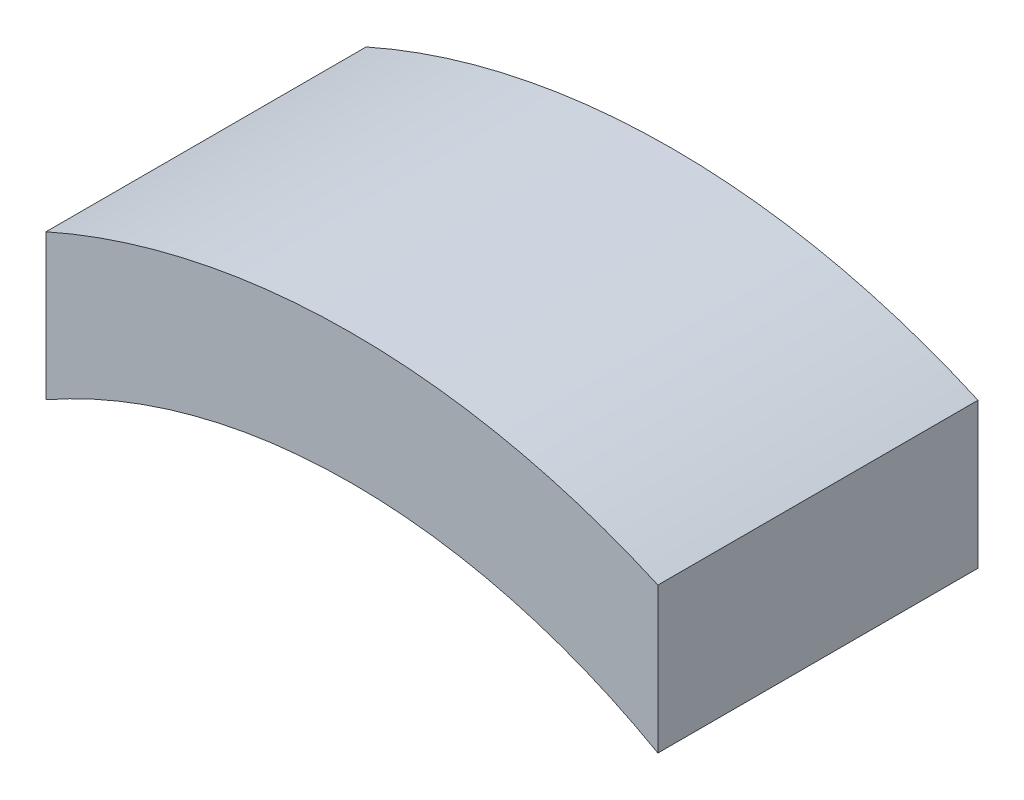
ISO-10303-21;
HEADER;
FILE_DESCRIPTION(('STEP AP214'),'2;1');
FILE_NAME('part.step','',(''),(''),'','','');
FILE_SCHEMA(('AUTOMOTIVE_DESIGN { 1 0 10303 214 1 1 1 1 }'));
ENDSEC;
DATA;
#1=APPLICATION_CONTEXT('core data for automotive mechanical design processes');
#2=APPLICATION_PROTOCOL_DEFINITION('international standard','automotive_design',2000,#1);
#3=PRODUCT_CONTEXT('',#1,'mechanical');
#4=PRODUCT('Part','Part','',(#3));
#5=PRODUCT_RELATED_PRODUCT_CATEGORY('part','',(#4));
#6=PRODUCT_DEFINITION_FORMATION('','',#4);
#7=PRODUCT_DEFINITION_CONTEXT('part definition',#1,'design');
#8=PRODUCT_DEFINITION('design','',#6,#7);
#9=PRODUCT_DEFINITION_SHAPE('','',#8);
#10=(LENGTH_UNIT() NAMED_UNIT(*) SI_UNIT(.MILLI.,.METRE.));
#11=(NAMED_UNIT(*) PLANE_ANGLE_UNIT() SI_UNIT($,.RADIAN.));
#12=(NAMED_UNIT(*) SI_UNIT($,.STERADIAN.) SOLID_ANGLE_UNIT());
#13=UNCERTAINTY_MEASURE_WITH_UNIT(LENGTH_MEASURE(1.E-05),#10,'distance_accuracy_value','');
#14=(GEOMETRIC_REPRESENTATION_CONTEXT(3) GLOBAL_UNCERTAINTY_ASSIGNED_CONTEXT((#13)) GLOBAL_UNIT_ASSIGNED_CONTEXT((#10,
#11,#12)) REPRESENTATION_CONTEXT('',''));
#15=CARTESIAN_POINT('',(0.,0.,0.));
#16=DIRECTION('',(0.,0.,1.));
#17=DIRECTION('',(1.,0.,0.));
#18=AXIS2_PLACEMENT_3D('',#15,#16,#17);
#19=CARTESIAN_POINT('',(-1.30910307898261,-154.292118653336,36.));
#20=DIRECTION('',(0.,0.,-1.));
#21=DIRECTION('',(-1.,0.,0.));
#22=AXIS2_PLACEMENT_3D('',#19,#20,#21);
#23=CYLINDRICAL_SURFACE('',#22,168.945096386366);
#24=CARTESIAN_POINT('',(-1.30910307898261,-154.292118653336,-36.));
#25=DIRECTION('',(0.,0.,1.));
#26=DIRECTION('',(-1.,0.,0.));
#27=AXIS2_PLACEMENT_3D('',#24,#25,#26);
#28=CIRCLE('',#27,168.945096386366);
#29=CARTESIAN_POINT('',(67.5123159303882,0.,-36.));
#30=VERTEX_POINT('',#29);
#31=CARTESIAN_POINT('',(-70.1305220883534,0.,-36.));
#32=VERTEX_POINT('',#31);
#33=EDGE_CURVE('E89',#30,#32,#28,.T.);
#34=ORIENTED_EDGE('',*,*,#33,.T.);
#35=DIRECTION('',(0.,0.,-1.));
#36=VECTOR('',#35,1.);
#37=CARTESIAN_POINT('',(-70.1305220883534,0.,36.));
#38=LINE('',#37,#36);
#39=CARTESIAN_POINT('',(-70.1305220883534,0.,36.));
#40=VERTEX_POINT('',#39);
#41=EDGE_CURVE('E12',#40,#32,#38,.T.);
#42=ORIENTED_EDGE('',*,*,#41,.F.);
#43=CARTESIAN_POINT('',(-1.30910307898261,-154.292118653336,36.));
#44=DIRECTION('',(0.,0.,1.));
#45=DIRECTION('',(-1.,0.,0.));
#46=AXIS2_PLACEMENT_3D('',#43,#44,#45);
#47=CIRCLE('',#46,168.945096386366);
#48=CARTESIAN_POINT('',(67.5123159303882,0.,36.));
#49=VERTEX_POINT('',#48);
#50=EDGE_CURVE('E107',#49,#40,#47,.T.);
#51=ORIENTED_EDGE('',*,*,#50,.F.);
#52=DIRECTION('',(0.,0.,-1.));
#53=VECTOR('',#52,1.);
#54=CARTESIAN_POINT('',(67.5123159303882,0.,36.));
#55=LINE('',#54,#53);
#56=EDGE_CURVE('E101',#49,#30,#55,.T.);
#57=ORIENTED_EDGE('',*,*,#56,.T.);
#58=EDGE_LOOP('',(#34,#42,#51,#57));
#59=FACE_BOUND('',#58,.T.);
#60=ADVANCED_FACE('F45',(#59),#23,.T.);
#61=CARTESIAN_POINT('',(-70.1305220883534,-32.7275769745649,36.));
#62=DIRECTION('',(1.,0.,0.));
#63=DIRECTION('',(0.,1.,0.));
#64=AXIS2_PLACEMENT_3D('',#61,#62,#63);
#65=PLANE('',#64);
#66=DIRECTION('',(0.,-1.,0.));
#67=VECTOR('',#66,1.);
#68=CARTESIAN_POINT('',(-70.1305220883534,-32.7275769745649,-36.));
#69=LINE('',#68,#67);
#70=CARTESIAN_POINT('',(-70.1305220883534,-32.7275769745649,-36.));
#71=VERTEX_POINT('',#70);
#72=EDGE_CURVE('E85',#32,#71,#69,.T.);
#73=ORIENTED_EDGE('',*,*,#72,.T.);
#74=DIRECTION('',(0.,0.,-1.));
#75=VECTOR('',#74,1.);
#76=CARTESIAN_POINT('',(-70.1305220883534,-32.7275769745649,36.));
#77=LINE('',#76,#75);
#78=CARTESIAN_POINT('',(-70.1305220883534,-32.7275769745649,36.));
#79=VERTEX_POINT('',#78);
#80=EDGE_CURVE('E52',#79,#71,#77,.T.);
#81=ORIENTED_EDGE('',*,*,#80,.F.);
#82=DIRECTION('',(0.,-1.,0.));
#83=VECTOR('',#82,1.);
#84=CARTESIAN_POINT('',(-70.1305220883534,-32.7275769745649,36.));
#85=LINE('',#84,#83);
#86=EDGE_CURVE('E97',#40,#79,#85,.T.);
#87=ORIENTED_EDGE('',*,*,#86,.F.);
#88=ORIENTED_EDGE('',*,*,#41,.T.);
#89=EDGE_LOOP('',(#73,#81,#87,#88));
#90=FACE_BOUND('',#89,.T.);
#91=ADVANCED_FACE('F96',(#90),#65,.F.);
#92=CARTESIAN_POINT('',(-1.3091030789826,-154.292118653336,36.));
#93=DIRECTION('',(0.,0.,-1.));
#94=DIRECTION('',(-1.,0.,0.));
#95=AXIS2_PLACEMENT_3D('',#92,#93,#94);
#96=CYLINDRICAL_SURFACE('',#95,139.69368456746);
#97=CARTESIAN_POINT('',(-1.3091030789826,-154.292118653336,-36.));
#98=DIRECTION('',(0.,0.,-1.));
#99=DIRECTION('',(-1.,0.,0.));
#100=AXIS2_PLACEMENT_3D('',#97,#98,#99);
#101=CIRCLE('',#100,139.69368456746);
#102=CARTESIAN_POINT('',(67.5123159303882,-32.7275769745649,-36.));
#103=VERTEX_POINT('',#102);
#104=EDGE_CURVE('E90',#71,#103,#101,.T.);
#105=ORIENTED_EDGE('',*,*,#104,.T.);
#106=DIRECTION('',(0.,0.,-1.));
#107=VECTOR('',#106,1.);
#108=CARTESIAN_POINT('',(67.5123159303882,-32.7275769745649,36.));
#109=LINE('',#108,#107);
#110=CARTESIAN_POINT('',(67.5123159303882,-32.7275769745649,36.));
#111=VERTEX_POINT('',#110);
#112=EDGE_CURVE('E113',#111,#103,#109,.T.);
#113=ORIENTED_EDGE('',*,*,#112,.F.);
#114=CARTESIAN_POINT('',(-1.3091030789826,-154.292118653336,36.));
#115=DIRECTION('',(0.,0.,-1.));
#116=DIRECTION('',(-1.,0.,0.));
#117=AXIS2_PLACEMENT_3D('',#114,#115,#116);
#118=CIRCLE('',#117,139.69368456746);
#119=EDGE_CURVE('E64',#79,#111,#118,.T.);
#120=ORIENTED_EDGE('',*,*,#119,.F.);
#121=ORIENTED_EDGE('',*,*,#80,.T.);
#122=EDGE_LOOP('',(#105,#113,#120,#121));
#123=FACE_BOUND('',#122,.T.);
#124=ADVANCED_FACE('F116',(#123),#96,.F.);
#125=CARTESIAN_POINT('',(67.5123159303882,0.,36.));
#126=DIRECTION('',(-1.,0.,0.));
#127=DIRECTION('',(0.,0.,1.));
#128=AXIS2_PLACEMENT_3D('',#125,#126,#127);
#129=PLANE('',#128);
#130=DIRECTION('',(0.,1.,0.));
#131=VECTOR('',#130,1.);
#132=CARTESIAN_POINT('',(67.5123159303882,0.,-36.));
#133=LINE('',#132,#131);
#134=EDGE_CURVE('E105',#103,#30,#133,.T.);
#135=ORIENTED_EDGE('',*,*,#134,.T.);
#136=ORIENTED_EDGE('',*,*,#56,.F.);
#137=DIRECTION('',(0.,1.,0.));
#138=VECTOR('',#137,1.);
#139=CARTESIAN_POINT('',(67.5123159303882,0.,36.));
#140=LINE('',#139,#138);
#141=EDGE_CURVE('E59',#111,#49,#140,.T.);
#142=ORIENTED_EDGE('',*,*,#141,.F.);
#143=ORIENTED_EDGE('',*,*,#112,.T.);
#144=EDGE_LOOP('',(#135,#136,#142,#143));
#145=FACE_BOUND('',#144,.T.);
#146=ADVANCED_FACE('F118',(#145),#129,.F.);
#147=CARTESIAN_POINT('',(-1.30910307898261,-154.292118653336,36.));
#148=DIRECTION('',(0.,0.,-1.));
#149=DIRECTION('',(-1.,0.,0.));
#150=AXIS2_PLACEMENT_3D('',#147,#148,#149);
#151=PLANE('',#150);
#152=ORIENTED_EDGE('',*,*,#50,.T.);
#153=ORIENTED_EDGE('',*,*,#86,.T.);
#154=ORIENTED_EDGE('',*,*,#119,.T.);
#155=ORIENTED_EDGE('',*,*,#141,.T.);
#156=EDGE_LOOP('',(#152,#153,#154,#155));
#157=FACE_BOUND('',#156,.T.);
#158=ADVANCED_FACE('F119',(#157),#151,.F.);
#159=CARTESIAN_POINT('',(-1.30910307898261,-154.292118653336,-36.));
#160=DIRECTION('',(0.,0.,-1.));
#161=DIRECTION('',(-1.,0.,0.));
#162=AXIS2_PLACEMENT_3D('',#159,#160,#161);
#163=PLANE('',#162);
#164=ORIENTED_EDGE('',*,*,#33,.F.);
#165=ORIENTED_EDGE('',*,*,#134,.F.);
#166=ORIENTED_EDGE('',*,*,#104,.F.);
#167=ORIENTED_EDGE('',*,*,#72,.F.);
#168=EDGE_LOOP('',(#164,#165,#166,#167));
#169=FACE_BOUND('',#168,.T.);
#170=ADVANCED_FACE('F86',(#169),#163,.T.);
#171=CLOSED_SHELL('',(#60,#91,#124,#146,#158,#170));
#172=MANIFOLD_SOLID_BREP('B2',#171);
#173=CARTESIAN_POINT('',(-1.30910307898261,-154.292118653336,36.));
#174=DIRECTION('',(0.,0.,-1.));
#175=DIRECTION('',(-1.,0.,0.));
#176=AXIS2_PLACEMENT_3D('',#173,#174,#175);
#177=CYLINDRICAL_SURFACE('',#176,154.319390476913);
#178=CARTESIAN_POINT('',(-1.30910307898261,-154.292118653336,36.));
#179=DIRECTION('',(0.,0.,-1.));
#180=DIRECTION('',(-1.,0.,0.));
#181=AXIS2_PLACEMENT_3D('',#178,#179,#180);
#182=CIRCLE('',#181,154.319390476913);
#183=CARTESIAN_POINT('',(-70.1305220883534,-16.1686718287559,36.));
#184=VERTEX_POINT('',#183);
#185=CARTESIAN_POINT('',(67.5123159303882,-16.1686718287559,36.));
#186=VERTEX_POINT('',#185);
#187=EDGE_CURVE('E174',#184,#186,#182,.T.);
#188=ORIENTED_EDGE('',*,*,#187,.T.);
#189=DIRECTION('',(0.,0.,-1.));
#190=VECTOR('',#189,1.);
#191=CARTESIAN_POINT('',(67.5123159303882,-16.1686718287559,36.));
#192=LINE('',#191,#190);
#193=CARTESIAN_POINT('',(67.5123159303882,-16.1686718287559,-36.));
#194=VERTEX_POINT('',#193);
#195=EDGE_CURVE('E43',#186,#194,#192,.T.);
#196=ORIENTED_EDGE('',*,*,#195,.T.);
#197=CARTESIAN_POINT('',(-1.30910307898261,-154.292118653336,-36.));
#198=DIRECTION('',(0.,0.,-1.));
#199=DIRECTION('',(-1.,0.,0.));
#200=AXIS2_PLACEMENT_3D('',#197,#198,#199);
#201=CIRCLE('',#200,154.319390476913);
#202=CARTESIAN_POINT('',(-70.1305220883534,-16.1686718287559,-36.));
#203=VERTEX_POINT('',#202);
#204=EDGE_CURVE('E189',#203,#194,#201,.T.);
#205=ORIENTED_EDGE('',*,*,#204,.F.);
#206=DIRECTION('',(0.,0.,-1.));
#207=VECTOR('',#206,1.);
#208=CARTESIAN_POINT('',(-70.1305220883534,-16.1686718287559,-36.));
#209=LINE('',#208,#207);
#210=EDGE_CURVE('E184',#203,#184,#209,.F.);
#211=ORIENTED_EDGE('',*,*,#210,.T.);
#212=EDGE_LOOP('',(#188,#196,#205,#211));
#213=FACE_BOUND('',#212,.T.);
#214=ADVANCED_FACE('F169',(#213),#177,.T.);
#215=OPEN_SHELL('',(#214));
#216=SHELL_BASED_SURFACE_MODEL('B6',(#215));
#217=ADVANCED_BREP_SHAPE_REPRESENTATION('',(#18,#172),#14);
#218=MANIFOLD_SURFACE_SHAPE_REPRESENTATION('',(#18,#216),#14);
#219=SHAPE_REPRESENTATION('',(#18),#14);
#220=SHAPE_DEFINITION_REPRESENTATION(#9,#219);
#221=SHAPE_REPRESENTATION_RELATIONSHIP('','',#219,#217);
#222=SHAPE_REPRESENTATION_RELATIONSHIP('','',#219,#218);
ENDSEC;
END-ISO-10303-21;
